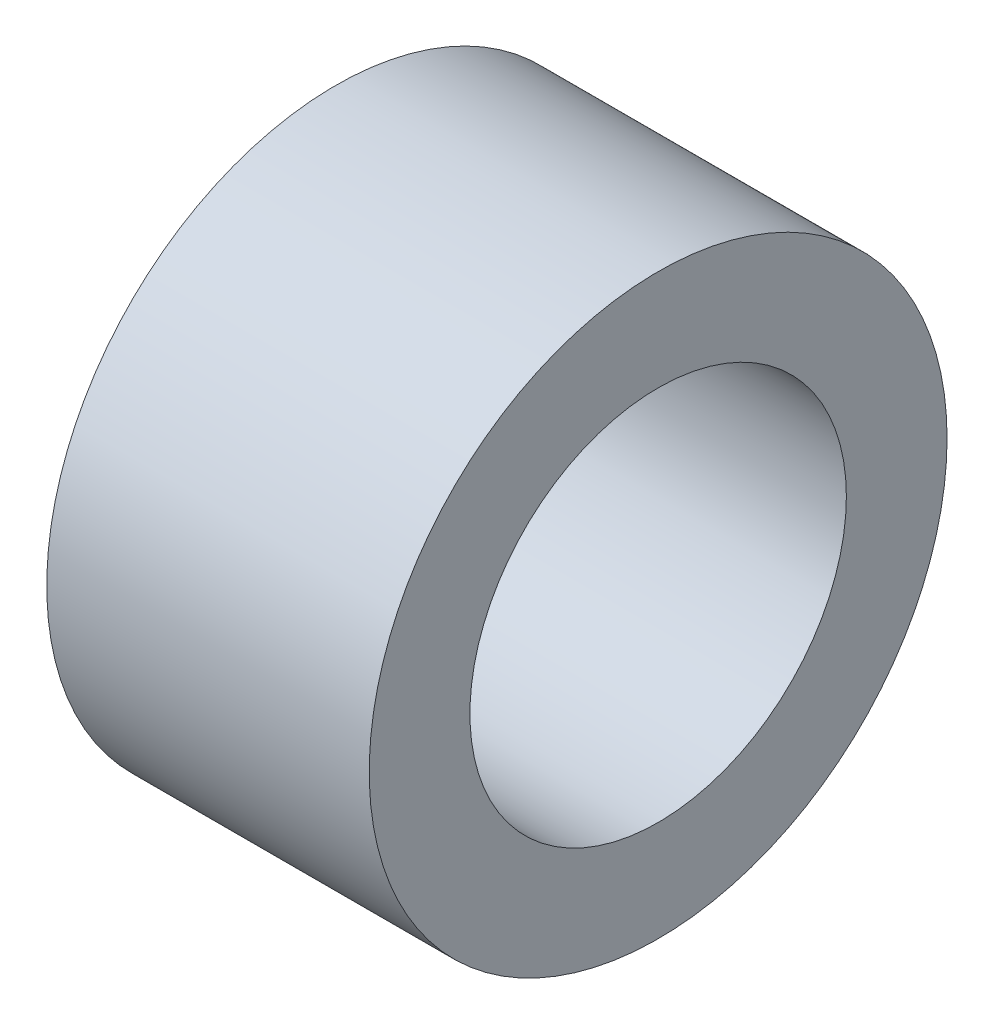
ISO-10303-21;
HEADER;
FILE_DESCRIPTION(('STEP AP214'),'2;1');
FILE_NAME('part.step','',(''),(''),'','','');
FILE_SCHEMA(('AUTOMOTIVE_DESIGN { 1 0 10303 214 1 1 1 1 }'));
ENDSEC;
DATA;
#1=APPLICATION_CONTEXT('core data for automotive mechanical design processes');
#2=APPLICATION_PROTOCOL_DEFINITION('international standard','automotive_design',2000,#1);
#3=PRODUCT_CONTEXT('',#1,'mechanical');
#4=PRODUCT('Part','Part','',(#3));
#5=PRODUCT_RELATED_PRODUCT_CATEGORY('part','',(#4));
#6=PRODUCT_DEFINITION_FORMATION('','',#4);
#7=PRODUCT_DEFINITION_CONTEXT('part definition',#1,'design');
#8=PRODUCT_DEFINITION('design','',#6,#7);
#9=PRODUCT_DEFINITION_SHAPE('','',#8);
#10=(LENGTH_UNIT() NAMED_UNIT(*) SI_UNIT(.MILLI.,.METRE.));
#11=(NAMED_UNIT(*) PLANE_ANGLE_UNIT() SI_UNIT($,.RADIAN.));
#12=(NAMED_UNIT(*) SI_UNIT($,.STERADIAN.) SOLID_ANGLE_UNIT());
#13=UNCERTAINTY_MEASURE_WITH_UNIT(LENGTH_MEASURE(1.E-05),#10,'distance_accuracy_value','');
#14=(GEOMETRIC_REPRESENTATION_CONTEXT(3) GLOBAL_UNCERTAINTY_ASSIGNED_CONTEXT((#13)) GLOBAL_UNIT_ASSIGNED_CONTEXT((#10,
#11,#12)) REPRESENTATION_CONTEXT('',''));
#15=CARTESIAN_POINT('',(0.,0.,0.));
#16=DIRECTION('',(0.,0.,1.));
#17=DIRECTION('',(1.,0.,0.));
#18=AXIS2_PLACEMENT_3D('',#15,#16,#17);
#19=CARTESIAN_POINT('',(-3.5,7.29661986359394,0.));
#20=DIRECTION('',(1.,0.,0.));
#21=DIRECTION('',(0.,0.,-1.));
#22=AXIS2_PLACEMENT_3D('',#19,#20,#21);
#23=PLANE('',#22);
#24=CARTESIAN_POINT('',(-3.5,0.,0.));
#25=DIRECTION('',(1.,0.,0.));
#26=DIRECTION('',(0.,0.,-1.));
#27=AXIS2_PLACEMENT_3D('',#24,#25,#26);
#28=CIRCLE('',#27,11.2);
#29=CARTESIAN_POINT('',(-3.5,0.,-11.2));
#30=VERTEX_POINT('',#29);
#31=EDGE_CURVE('E10',#30,#30,#28,.T.);
#32=ORIENTED_EDGE('',*,*,#31,.T.);
#33=EDGE_LOOP('',(#32));
#34=FACE_BOUND('',#33,.T.);
#35=CARTESIAN_POINT('',(-3.5,0.,0.));
#36=DIRECTION('',(1.,0.,0.));
#37=DIRECTION('',(0.,0.,-1.));
#38=AXIS2_PLACEMENT_3D('',#35,#36,#37);
#39=CIRCLE('',#38,7.29661986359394);
#40=CARTESIAN_POINT('',(-3.5,0.,-7.29661986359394));
#41=VERTEX_POINT('',#40);
#42=EDGE_CURVE('E43',#41,#41,#39,.T.);
#43=ORIENTED_EDGE('',*,*,#42,.F.);
#44=EDGE_LOOP('',(#43));
#45=FACE_BOUND('',#44,.T.);
#46=ADVANCED_FACE('F29',(#34,#45),#23,.T.);
#47=CARTESIAN_POINT('',(0.,0.,0.));
#48=DIRECTION('',(1.,0.,0.));
#49=DIRECTION('',(0.,0.,-1.));
#50=AXIS2_PLACEMENT_3D('',#47,#48,#49);
#51=CYLINDRICAL_SURFACE('',#50,11.2);
#52=CARTESIAN_POINT('',(-16.,0.,0.));
#53=DIRECTION('',(1.,0.,0.));
#54=DIRECTION('',(0.,0.,-1.));
#55=AXIS2_PLACEMENT_3D('',#52,#53,#54);
#56=CIRCLE('',#55,11.2);
#57=CARTESIAN_POINT('',(-16.,0.,-11.2));
#58=VERTEX_POINT('',#57);
#59=EDGE_CURVE('E35',#58,#58,#56,.T.);
#60=ORIENTED_EDGE('',*,*,#59,.T.);
#61=EDGE_LOOP('',(#60));
#62=FACE_BOUND('',#61,.T.);
#63=ORIENTED_EDGE('',*,*,#31,.F.);
#64=EDGE_LOOP('',(#63));
#65=FACE_BOUND('',#64,.T.);
#66=ADVANCED_FACE('F53',(#62,#65),#51,.T.);
#67=CARTESIAN_POINT('',(-16.,11.2,0.));
#68=DIRECTION('',(-1.,0.,0.));
#69=DIRECTION('',(0.,0.,1.));
#70=AXIS2_PLACEMENT_3D('',#67,#68,#69);
#71=PLANE('',#70);
#72=CARTESIAN_POINT('',(-16.,0.,0.));
#73=DIRECTION('',(1.,0.,0.));
#74=DIRECTION('',(0.,0.,-1.));
#75=AXIS2_PLACEMENT_3D('',#72,#73,#74);
#76=CIRCLE('',#75,7.29661986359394);
#77=CARTESIAN_POINT('',(-16.,0.,-7.29661986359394));
#78=VERTEX_POINT('',#77);
#79=EDGE_CURVE('E39',#78,#78,#76,.T.);
#80=ORIENTED_EDGE('',*,*,#79,.T.);
#81=EDGE_LOOP('',(#80));
#82=FACE_BOUND('',#81,.T.);
#83=ORIENTED_EDGE('',*,*,#59,.F.);
#84=EDGE_LOOP('',(#83));
#85=FACE_BOUND('',#84,.T.);
#86=ADVANCED_FACE('F57',(#82,#85),#71,.T.);
#87=CARTESIAN_POINT('',(0.,0.,0.));
#88=DIRECTION('',(1.,0.,0.));
#89=DIRECTION('',(0.,0.,-1.));
#90=AXIS2_PLACEMENT_3D('',#87,#88,#89);
#91=CYLINDRICAL_SURFACE('',#90,7.29661986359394);
#92=ORIENTED_EDGE('',*,*,#42,.T.);
#93=EDGE_LOOP('',(#92));
#94=FACE_BOUND('',#93,.T.);
#95=ORIENTED_EDGE('',*,*,#79,.F.);
#96=EDGE_LOOP('',(#95));
#97=FACE_BOUND('',#96,.T.);
#98=ADVANCED_FACE('F49',(#94,#97),#91,.F.);
#99=CLOSED_SHELL('',(#46,#66,#86,#98));
#100=MANIFOLD_SOLID_BREP('B2',#99);
#101=ADVANCED_BREP_SHAPE_REPRESENTATION('',(#18,#100),#14);
#102=SHAPE_DEFINITION_REPRESENTATION(#9,#101);
ENDSEC;
END-ISO-10303-21;
